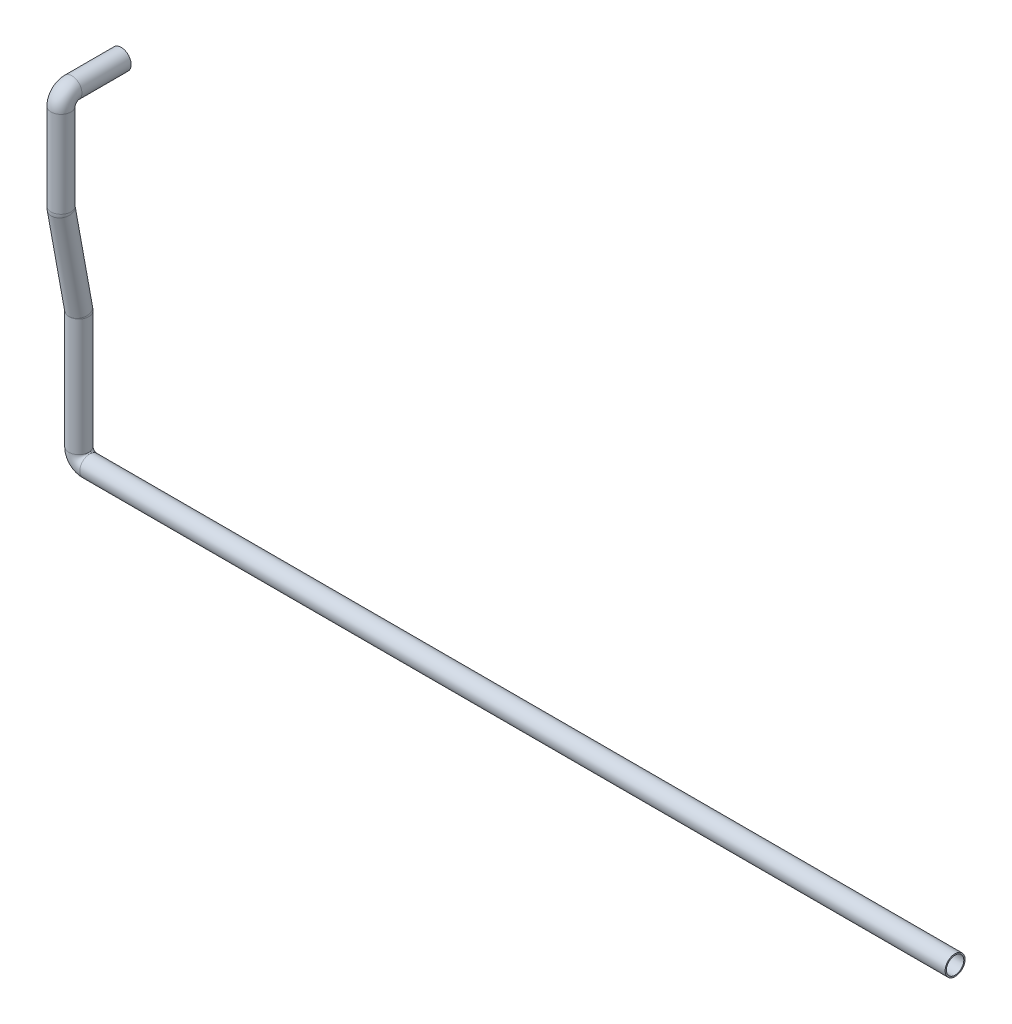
from build123d import *

# Parameters (mm, degrees)
CROQUIS1_R   = 36.5
CROQUIS1_R_2 = 31.75


with BuildPart() as part:
    # Barrer1: sweep along a curve in space
    with BuildLine() as barrer1_path:
        Line((0, 0, 0), (0, 0, 180))
        ThreePointArc((0, 0, 180), (0, -11.715728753, 208.284271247), (0, -40, 220))
        Line((0, -40, 220), (0, -356.388232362, 220))
        ThreePointArc((0, -356.388232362, 220), (0, -359.985365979, 219.837929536), (0, -363.55335014, 219.353031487))
        Line((0, -363.55335014, 219.353031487), (0, -713.44664986, 155.646968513))
        ThreePointArc((0, -713.44664986, 155.646968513), (0, -717.014634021, 155.162070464), (0, -720.611767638, 155))
        Line((0, -720.611767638, 155), (0, -1150, 155))
        ThreePointArc((0, -1150, 155), (11.715728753, -1178.284271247, 155), (40, -1190, 155))
        Line((40, -1190, 155), (3204, -1190, 155))
    # Croquis1 → Barrer1 (sweep)
    with BuildSketch(Plane.XY):
        Circle(CROQUIS1_R)
        Circle(CROQUIS1_R_2, mode=Mode.SUBTRACT)
    sweep(path=barrer1_path.line)


solid = part.part
